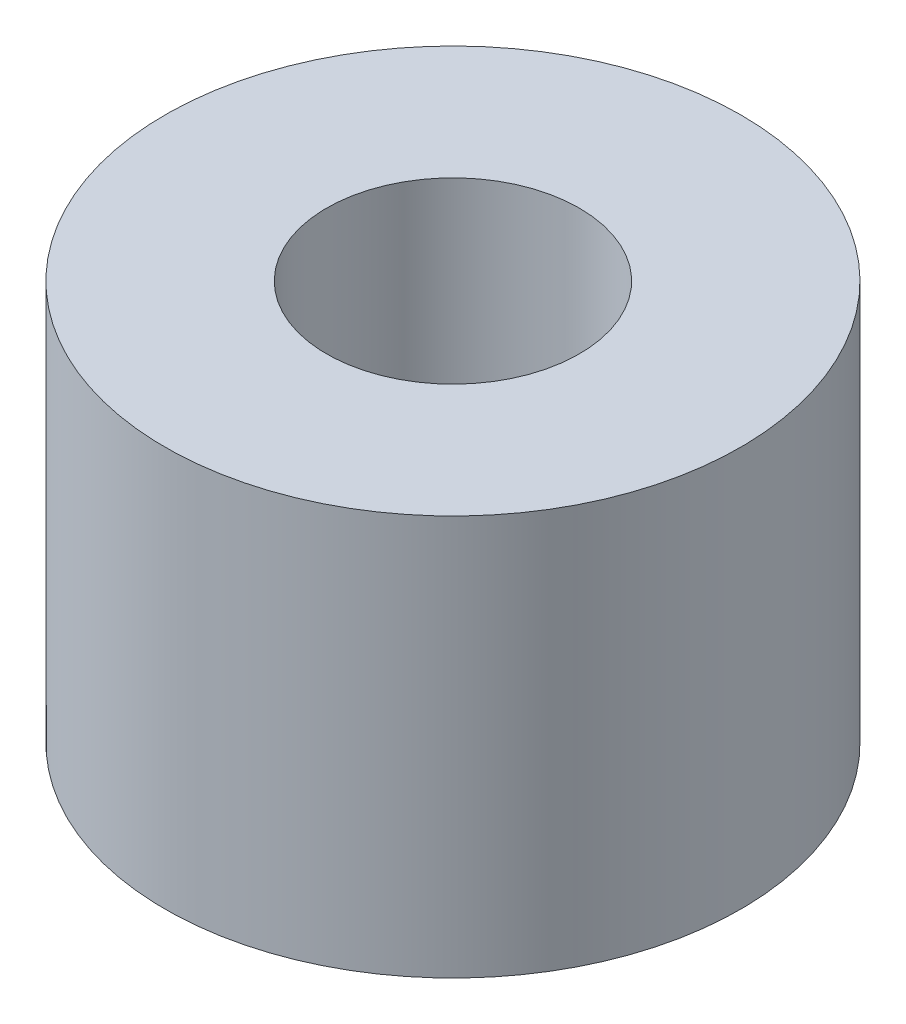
from build123d import *

# Parameters (mm, degrees)
ESQUISSE1_W = 46
ESQUISSE1_H = 114


with BuildPart() as part:
    # Esquisse1 → R_volution1 (revolve)
    with BuildSketch(Plane.XY, mode=Mode.PRIVATE) as r_volution1_sk:
        with Locations((-59, 57)):
            Rectangle(ESQUISSE1_W, ESQUISSE1_H)
    revolve(r_volution1_sk.sketch.rotate(Axis((0, 0, 0), (0, 1, 0)), 270), axis=Axis((0, 0, 0), (0, 1, 0)))


solid = part.part
